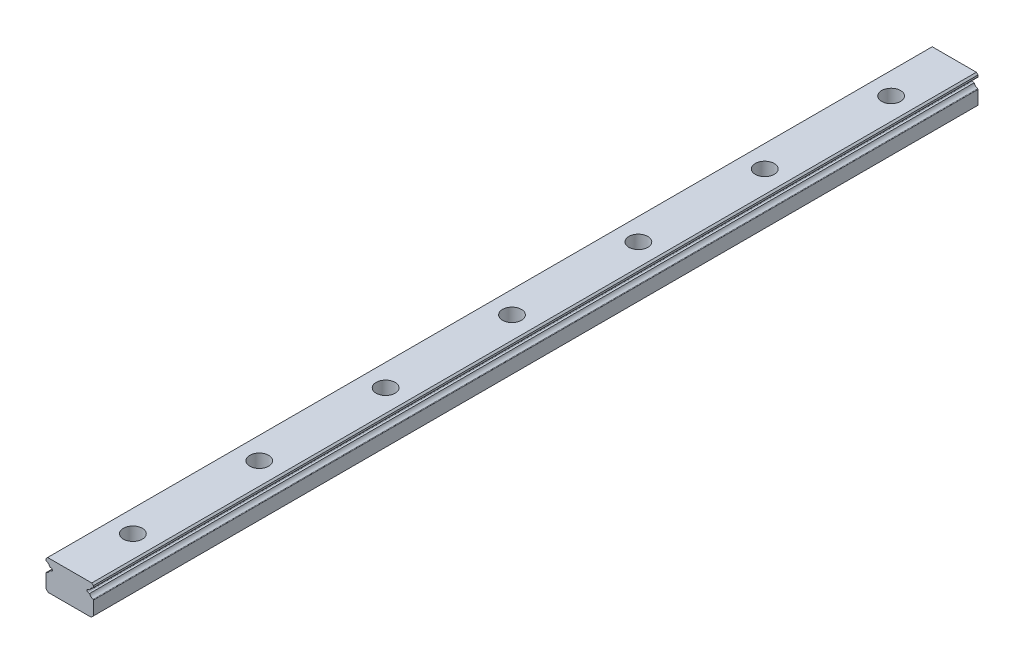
ISO-10303-21;
HEADER;
FILE_DESCRIPTION(('STEP AP214'),'2;1');
FILE_NAME('part.step','',(''),(''),'','','');
FILE_SCHEMA(('AUTOMOTIVE_DESIGN { 1 0 10303 214 1 1 1 1 }'));
ENDSEC;
DATA;
#1=APPLICATION_CONTEXT('core data for automotive mechanical design processes');
#2=APPLICATION_PROTOCOL_DEFINITION('international standard','automotive_design',2000,#1);
#3=PRODUCT_CONTEXT('',#1,'mechanical');
#4=PRODUCT('Part','Part','',(#3));
#5=PRODUCT_RELATED_PRODUCT_CATEGORY('part','',(#4));
#6=PRODUCT_DEFINITION_FORMATION('','',#4);
#7=PRODUCT_DEFINITION_CONTEXT('part definition',#1,'design');
#8=PRODUCT_DEFINITION('design','',#6,#7);
#9=PRODUCT_DEFINITION_SHAPE('','',#8);
#10=(LENGTH_UNIT() NAMED_UNIT(*) SI_UNIT(.MILLI.,.METRE.));
#11=(NAMED_UNIT(*) PLANE_ANGLE_UNIT() SI_UNIT($,.RADIAN.));
#12=(NAMED_UNIT(*) SI_UNIT($,.STERADIAN.) SOLID_ANGLE_UNIT());
#13=UNCERTAINTY_MEASURE_WITH_UNIT(LENGTH_MEASURE(1.E-05),#10,'distance_accuracy_value','');
#14=(GEOMETRIC_REPRESENTATION_CONTEXT(3) GLOBAL_UNCERTAINTY_ASSIGNED_CONTEXT((#13)) GLOBAL_UNIT_ASSIGNED_CONTEXT((#10,
#11,#12)) REPRESENTATION_CONTEXT('',''));
#15=CARTESIAN_POINT('',(0.,0.,0.));
#16=DIRECTION('',(0.,0.,1.));
#17=DIRECTION('',(1.,0.,0.));
#18=AXIS2_PLACEMENT_3D('',#15,#16,#17);
#19=CARTESIAN_POINT('',(-6.27999999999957,-8.749,-280.));
#20=DIRECTION('',(-0.209659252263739,-0.977774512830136,0.));
#21=DIRECTION('',(0.977774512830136,-0.209659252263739,0.));
#22=AXIS2_PLACEMENT_3D('',#19,#20,#21);
#23=PLANE('',#22);
#24=DIRECTION('',(0.977774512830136,-0.209659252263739,0.));
#25=VECTOR('',#24,1.);
#26=CARTESIAN_POINT('',(-6.27999999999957,-8.749,-280.));
#27=LINE('',#26,#25);
#28=CARTESIAN_POINT('',(-6.27999999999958,-8.749,-280.));
#29=VERTEX_POINT('',#28);
#30=CARTESIAN_POINT('',(-5.76751090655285,-8.85889044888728,-280.));
#31=VERTEX_POINT('',#30);
#32=EDGE_CURVE('E211',#29,#31,#27,.T.);
#33=ORIENTED_EDGE('',*,*,#32,.T.);
#34=DIRECTION('',(0.,0.,-1.));
#35=VECTOR('',#34,1.);
#36=CARTESIAN_POINT('',(-5.76751053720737,-8.85889052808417,-280.));
#37=LINE('',#36,#35);
#38=CARTESIAN_POINT('',(-5.76751090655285,-8.85889044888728,0.));
#39=VERTEX_POINT('',#38);
#40=EDGE_CURVE('E182',#31,#39,#37,.F.);
#41=ORIENTED_EDGE('',*,*,#40,.T.);
#42=DIRECTION('',(0.977774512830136,-0.209659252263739,0.));
#43=VECTOR('',#42,1.);
#44=CARTESIAN_POINT('',(-6.27999999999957,-8.749,0.));
#45=LINE('',#44,#43);
#46=CARTESIAN_POINT('',(-6.27999999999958,-8.749,0.));
#47=VERTEX_POINT('',#46);
#48=EDGE_CURVE('E219',#39,#47,#45,.F.);
#49=ORIENTED_EDGE('',*,*,#48,.T.);
#50=DIRECTION('',(0.,0.,-1.));
#51=VECTOR('',#50,1.);
#52=CARTESIAN_POINT('',(-6.27999999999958,-8.749,-280.));
#53=LINE('',#52,#51);
#54=EDGE_CURVE('E214',#47,#29,#53,.T.);
#55=ORIENTED_EDGE('',*,*,#54,.T.);
#56=EDGE_LOOP('',(#33,#41,#49,#55));
#57=FACE_BOUND('',#56,.T.);
#58=ADVANCED_FACE('F16',(#57),#23,.T.);
#59=CARTESIAN_POINT('',(5.7675105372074,-8.85889052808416,-280.));
#60=DIRECTION('',(0.20965925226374,-0.977774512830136,0.));
#61=DIRECTION('',(0.977774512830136,0.20965925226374,0.));
#62=AXIS2_PLACEMENT_3D('',#59,#60,#61);
#63=PLANE('',#62);
#64=DIRECTION('',(0.977774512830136,0.20965925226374,0.));
#65=VECTOR('',#64,1.);
#66=CARTESIAN_POINT('',(5.7675105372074,-8.85889052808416,-280.));
#67=LINE('',#66,#65);
#68=CARTESIAN_POINT('',(5.76751090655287,-8.85889044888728,-280.));
#69=VERTEX_POINT('',#68);
#70=CARTESIAN_POINT('',(6.27999999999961,-8.749,-280.));
#71=VERTEX_POINT('',#70);
#72=EDGE_CURVE('E184',#69,#71,#67,.T.);
#73=ORIENTED_EDGE('',*,*,#72,.T.);
#74=DIRECTION('',(0.,0.,-1.));
#75=VECTOR('',#74,1.);
#76=CARTESIAN_POINT('',(6.27999999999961,-8.749,-280.));
#77=LINE('',#76,#75);
#78=CARTESIAN_POINT('',(6.27999999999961,-8.749,0.));
#79=VERTEX_POINT('',#78);
#80=EDGE_CURVE('E222',#71,#79,#77,.F.);
#81=ORIENTED_EDGE('',*,*,#80,.T.);
#82=DIRECTION('',(0.977774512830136,0.20965925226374,0.));
#83=VECTOR('',#82,1.);
#84=CARTESIAN_POINT('',(5.7675105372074,-8.85889052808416,0.));
#85=LINE('',#84,#83);
#86=CARTESIAN_POINT('',(5.76751090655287,-8.85889044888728,0.));
#87=VERTEX_POINT('',#86);
#88=EDGE_CURVE('E209',#79,#87,#85,.F.);
#89=ORIENTED_EDGE('',*,*,#88,.T.);
#90=DIRECTION('',(0.,0.,-1.));
#91=VECTOR('',#90,1.);
#92=CARTESIAN_POINT('',(5.7675105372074,-8.85889052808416,-280.));
#93=LINE('',#92,#91);
#94=EDGE_CURVE('E204',#87,#69,#93,.T.);
#95=ORIENTED_EDGE('',*,*,#94,.T.);
#96=EDGE_LOOP('',(#73,#81,#89,#95));
#97=FACE_BOUND('',#96,.T.);
#98=ADVANCED_FACE('F960',(#97),#63,.T.);
#99=CARTESIAN_POINT('',(-5.85137497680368,-9.25000017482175,-280.));
#100=DIRECTION('',(0.,0.,-1.));
#101=DIRECTION('',(-1.,0.,0.));
#102=AXIS2_PLACEMENT_3D('',#99,#100,#101);
#103=CYLINDRICAL_SURFACE('',#102,0.4);
#104=ORIENTED_EDGE('',*,*,#40,.F.);
#105=CARTESIAN_POINT('',(-5.85137497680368,-9.25000017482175,-280.));
#106=DIRECTION('',(0.,0.,-1.));
#107=DIRECTION('',(-1.,0.,0.));
#108=AXIS2_PLACEMENT_3D('',#105,#106,#107);
#109=CIRCLE('',#108,0.4);
#110=CARTESIAN_POINT('',(-5.767,-9.641,-280.));
#111=VERTEX_POINT('',#110);
#112=EDGE_CURVE('E19',#111,#31,#109,.F.);
#113=ORIENTED_EDGE('',*,*,#112,.F.);
#114=DIRECTION('',(0.,0.,1.));
#115=VECTOR('',#114,1.);
#116=CARTESIAN_POINT('',(-5.767,-9.641,-280.));
#117=LINE('',#116,#115);
#118=CARTESIAN_POINT('',(-5.767,-9.641,0.));
#119=VERTEX_POINT('',#118);
#120=EDGE_CURVE('E179',#119,#111,#117,.F.);
#121=ORIENTED_EDGE('',*,*,#120,.F.);
#122=CARTESIAN_POINT('',(-5.85137497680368,-9.25000017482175,0.));
#123=DIRECTION('',(0.,0.,-1.));
#124=DIRECTION('',(-1.,0.,0.));
#125=AXIS2_PLACEMENT_3D('',#122,#123,#124);
#126=CIRCLE('',#125,0.4);
#127=EDGE_CURVE('E226',#39,#119,#126,.T.);
#128=ORIENTED_EDGE('',*,*,#127,.F.);
#129=EDGE_LOOP('',(#104,#113,#121,#128));
#130=FACE_BOUND('',#129,.T.);
#131=ADVANCED_FACE('F176',(#130),#103,.F.);
#132=CARTESIAN_POINT('',(7.89004225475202,-9.33975285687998,-280.));
#133=DIRECTION('',(0.,0.,-1.));
#134=DIRECTION('',(-1.,0.,0.));
#135=AXIS2_PLACEMENT_3D('',#132,#133,#134);
#136=CYLINDRICAL_SURFACE('',#135,1.715);
#137=ORIENTED_EDGE('',*,*,#80,.F.);
#138=CARTESIAN_POINT('',(7.89004225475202,-9.33975285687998,-280.));
#139=DIRECTION('',(0.,0.,-1.));
#140=DIRECTION('',(-1.,0.,0.));
#141=AXIS2_PLACEMENT_3D('',#138,#139,#140);
#142=CIRCLE('',#141,1.715);
#143=CARTESIAN_POINT('',(7.35000000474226,-7.71199999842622,-280.));
#144=VERTEX_POINT('',#143);
#145=EDGE_CURVE('E225',#144,#71,#142,.F.);
#146=ORIENTED_EDGE('',*,*,#145,.F.);
#147=DIRECTION('',(0.,0.,-1.));
#148=VECTOR('',#147,1.);
#149=CARTESIAN_POINT('',(7.35000000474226,-7.71199999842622,-280.));
#150=LINE('',#149,#148);
#151=CARTESIAN_POINT('',(7.35000000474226,-7.71199999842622,0.));
#152=VERTEX_POINT('',#151);
#153=EDGE_CURVE('E202',#152,#144,#150,.T.);
#154=ORIENTED_EDGE('',*,*,#153,.F.);
#155=CARTESIAN_POINT('',(7.89004225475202,-9.33975285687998,0.));
#156=DIRECTION('',(0.,0.,-1.));
#157=DIRECTION('',(-1.,0.,0.));
#158=AXIS2_PLACEMENT_3D('',#155,#156,#157);
#159=CIRCLE('',#158,1.715);
#160=EDGE_CURVE('E218',#79,#152,#159,.T.);
#161=ORIENTED_EDGE('',*,*,#160,.F.);
#162=EDGE_LOOP('',(#137,#146,#154,#161));
#163=FACE_BOUND('',#162,.T.);
#164=ADVANCED_FACE('F944',(#163),#136,.F.);
#165=CARTESIAN_POINT('',(-7.890042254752,-9.33975285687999,-280.));
#166=DIRECTION('',(0.,0.,-1.));
#167=DIRECTION('',(-1.,0.,0.));
#168=AXIS2_PLACEMENT_3D('',#165,#166,#167);
#169=CYLINDRICAL_SURFACE('',#168,1.715);
#170=DIRECTION('',(0.,0.,-1.));
#171=VECTOR('',#170,1.);
#172=CARTESIAN_POINT('',(-7.34999999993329,-7.7120000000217,-280.));
#173=LINE('',#172,#171);
#174=CARTESIAN_POINT('',(-7.34999999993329,-7.71200000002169,-280.));
#175=VERTEX_POINT('',#174);
#176=CARTESIAN_POINT('',(-7.34999999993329,-7.7120000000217,0.));
#177=VERTEX_POINT('',#176);
#178=EDGE_CURVE('E345',#175,#177,#173,.F.);
#179=ORIENTED_EDGE('',*,*,#178,.F.);
#180=CARTESIAN_POINT('',(-7.890042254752,-9.33975285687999,-280.));
#181=DIRECTION('',(0.,0.,-1.));
#182=DIRECTION('',(-1.,0.,0.));
#183=AXIS2_PLACEMENT_3D('',#180,#181,#182);
#184=CIRCLE('',#183,1.715);
#185=EDGE_CURVE('E217',#29,#175,#184,.F.);
#186=ORIENTED_EDGE('',*,*,#185,.F.);
#187=ORIENTED_EDGE('',*,*,#54,.F.);
#188=CARTESIAN_POINT('',(-7.890042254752,-9.33975285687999,0.));
#189=DIRECTION('',(0.,0.,-1.));
#190=DIRECTION('',(-1.,0.,0.));
#191=AXIS2_PLACEMENT_3D('',#188,#189,#190);
#192=CIRCLE('',#191,1.715);
#193=EDGE_CURVE('E208',#177,#47,#192,.T.);
#194=ORIENTED_EDGE('',*,*,#193,.F.);
#195=EDGE_LOOP('',(#179,#186,#187,#194));
#196=FACE_BOUND('',#195,.T.);
#197=ADVANCED_FACE('F370',(#196),#169,.F.);
#198=CARTESIAN_POINT('',(5.85137497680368,-9.25000017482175,-280.));
#199=DIRECTION('',(0.,0.,-1.));
#200=DIRECTION('',(-1.,0.,0.));
#201=AXIS2_PLACEMENT_3D('',#198,#199,#200);
#202=CYLINDRICAL_SURFACE('',#201,0.4);
#203=DIRECTION('',(0.,0.,1.));
#204=VECTOR('',#203,1.);
#205=CARTESIAN_POINT('',(5.767,-9.641,-280.));
#206=LINE('',#205,#204);
#207=CARTESIAN_POINT('',(5.767,-9.641,-280.));
#208=VERTEX_POINT('',#207);
#209=CARTESIAN_POINT('',(5.767,-9.641,0.));
#210=VERTEX_POINT('',#209);
#211=EDGE_CURVE('E341',#208,#210,#206,.T.);
#212=ORIENTED_EDGE('',*,*,#211,.F.);
#213=CARTESIAN_POINT('',(5.85137497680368,-9.25000017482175,-280.));
#214=DIRECTION('',(0.,0.,-1.));
#215=DIRECTION('',(-1.,0.,0.));
#216=AXIS2_PLACEMENT_3D('',#213,#214,#215);
#217=CIRCLE('',#216,0.4);
#218=EDGE_CURVE('E207',#69,#208,#217,.F.);
#219=ORIENTED_EDGE('',*,*,#218,.F.);
#220=ORIENTED_EDGE('',*,*,#94,.F.);
#221=CARTESIAN_POINT('',(5.85137497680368,-9.25000017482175,0.));
#222=DIRECTION('',(0.,0.,-1.));
#223=DIRECTION('',(-1.,0.,0.));
#224=AXIS2_PLACEMENT_3D('',#221,#222,#223);
#225=CIRCLE('',#224,0.4);
#226=EDGE_CURVE('E198',#210,#87,#225,.T.);
#227=ORIENTED_EDGE('',*,*,#226,.F.);
#228=EDGE_LOOP('',(#212,#219,#220,#227));
#229=FACE_BOUND('',#228,.T.);
#230=ADVANCED_FACE('F928',(#229),#202,.F.);
#231=CARTESIAN_POINT('',(-5.767,-9.641,-280.));
#232=DIRECTION('',(-0.207835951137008,0.978163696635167,0.));
#233=DIRECTION('',(-0.978163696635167,-0.207835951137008,0.));
#234=AXIS2_PLACEMENT_3D('',#231,#232,#233);
#235=PLANE('',#234);
#236=DIRECTION('',(-0.978163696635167,-0.207835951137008,0.));
#237=VECTOR('',#236,1.);
#238=CARTESIAN_POINT('',(-5.767,-9.641,-280.));
#239=LINE('',#238,#237);
#240=CARTESIAN_POINT('',(-6.28,-9.75,-280.));
#241=VERTEX_POINT('',#240);
#242=EDGE_CURVE('E186',#111,#241,#239,.T.);
#243=ORIENTED_EDGE('',*,*,#242,.T.);
#244=DIRECTION('',(0.,0.,-1.));
#245=VECTOR('',#244,1.);
#246=CARTESIAN_POINT('',(-6.28,-9.75,-280.));
#247=LINE('',#246,#245);
#248=CARTESIAN_POINT('',(-6.28,-9.75,0.));
#249=VERTEX_POINT('',#248);
#250=EDGE_CURVE('E339',#241,#249,#247,.F.);
#251=ORIENTED_EDGE('',*,*,#250,.T.);
#252=DIRECTION('',(-0.978163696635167,-0.207835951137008,0.));
#253=VECTOR('',#252,1.);
#254=CARTESIAN_POINT('',(-5.767,-9.641,0.));
#255=LINE('',#254,#253);
#256=EDGE_CURVE('E196',#249,#119,#255,.F.);
#257=ORIENTED_EDGE('',*,*,#256,.T.);
#258=ORIENTED_EDGE('',*,*,#120,.T.);
#259=EDGE_LOOP('',(#243,#251,#257,#258));
#260=FACE_BOUND('',#259,.T.);
#261=ADVANCED_FACE('F195',(#260),#235,.T.);
#262=CARTESIAN_POINT('',(7.287,-7.52218166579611,-280.));
#263=DIRECTION('',(0.,0.,-1.));
#264=DIRECTION('',(-1.,0.,0.));
#265=AXIS2_PLACEMENT_3D('',#262,#263,#264);
#266=CYLINDRICAL_SURFACE('',#265,0.2);
#267=CARTESIAN_POINT('',(7.287,-7.52218166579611,-280.));
#268=DIRECTION('',(0.,0.,-1.));
#269=DIRECTION('',(-1.,0.,0.));
#270=AXIS2_PLACEMENT_3D('',#267,#268,#269);
#271=CIRCLE('',#270,0.2);
#272=CARTESIAN_POINT('',(7.487,-7.52218165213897,-280.));
#273=VERTEX_POINT('',#272);
#274=EDGE_CURVE('E349',#144,#273,#271,.F.);
#275=ORIENTED_EDGE('',*,*,#274,.T.);
#276=DIRECTION('',(0.,0.,-1.));
#277=VECTOR('',#276,1.);
#278=CARTESIAN_POINT('',(7.487,-7.52218163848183,-280.));
#279=LINE('',#278,#277);
#280=CARTESIAN_POINT('',(7.487,-7.52218165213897,0.));
#281=VERTEX_POINT('',#280);
#282=EDGE_CURVE('E407',#281,#273,#279,.T.);
#283=ORIENTED_EDGE('',*,*,#282,.F.);
#284=CARTESIAN_POINT('',(7.287,-7.52218166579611,0.));
#285=DIRECTION('',(0.,0.,-1.));
#286=DIRECTION('',(-1.,0.,0.));
#287=AXIS2_PLACEMENT_3D('',#284,#285,#286);
#288=CIRCLE('',#287,0.2);
#289=EDGE_CURVE('E193',#281,#152,#288,.T.);
#290=ORIENTED_EDGE('',*,*,#289,.T.);
#291=ORIENTED_EDGE('',*,*,#153,.T.);
#292=EDGE_LOOP('',(#275,#283,#290,#291));
#293=FACE_BOUND('',#292,.T.);
#294=ADVANCED_FACE('F913',(#293),#266,.T.);
#295=CARTESIAN_POINT('',(-7.288,-7.52185268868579,-280.));
#296=DIRECTION('',(0.,0.,-1.));
#297=DIRECTION('',(-1.,0.,0.));
#298=AXIS2_PLACEMENT_3D('',#295,#296,#297);
#299=CYLINDRICAL_SURFACE('',#298,0.200000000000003);
#300=CARTESIAN_POINT('',(-7.288,-7.52185268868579,-280.));
#301=DIRECTION('',(0.,0.,-1.));
#302=DIRECTION('',(-1.,0.,0.));
#303=AXIS2_PLACEMENT_3D('',#300,#301,#302);
#304=CIRCLE('',#303,0.200000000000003);
#305=CARTESIAN_POINT('',(-7.488,-7.52185267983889,-280.));
#306=VERTEX_POINT('',#305);
#307=EDGE_CURVE('E342',#306,#175,#304,.F.);
#308=ORIENTED_EDGE('',*,*,#307,.T.);
#309=ORIENTED_EDGE('',*,*,#178,.T.);
#310=CARTESIAN_POINT('',(-7.288,-7.52185268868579,0.));
#311=DIRECTION('',(0.,0.,-1.));
#312=DIRECTION('',(-1.,0.,0.));
#313=AXIS2_PLACEMENT_3D('',#310,#311,#312);
#314=CIRCLE('',#313,0.200000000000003);
#315=CARTESIAN_POINT('',(-7.488,-7.52185267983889,0.));
#316=VERTEX_POINT('',#315);
#317=EDGE_CURVE('E346',#177,#316,#314,.T.);
#318=ORIENTED_EDGE('',*,*,#317,.T.);
#319=DIRECTION('',(0.,0.,1.));
#320=VECTOR('',#319,1.);
#321=CARTESIAN_POINT('',(-7.488,-7.52185267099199,-280.));
#322=LINE('',#321,#320);
#323=EDGE_CURVE('E375',#306,#316,#322,.T.);
#324=ORIENTED_EDGE('',*,*,#323,.F.);
#325=EDGE_LOOP('',(#308,#309,#318,#324));
#326=FACE_BOUND('',#325,.T.);
#327=ADVANCED_FACE('F373',(#326),#299,.T.);
#328=CARTESIAN_POINT('',(6.28,-9.75,-280.));
#329=DIRECTION('',(0.207835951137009,0.978163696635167,0.));
#330=DIRECTION('',(-0.978163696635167,0.207835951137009,0.));
#331=AXIS2_PLACEMENT_3D('',#328,#329,#330);
#332=PLANE('',#331);
#333=DIRECTION('',(-0.978163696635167,0.207835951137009,0.));
#334=VECTOR('',#333,1.);
#335=CARTESIAN_POINT('',(6.28,-9.75,-280.));
#336=LINE('',#335,#334);
#337=CARTESIAN_POINT('',(6.28,-9.75,-280.));
#338=VERTEX_POINT('',#337);
#339=EDGE_CURVE('E431',#338,#208,#336,.T.);
#340=ORIENTED_EDGE('',*,*,#339,.T.);
#341=ORIENTED_EDGE('',*,*,#211,.T.);
#342=DIRECTION('',(-0.978163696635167,0.207835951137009,0.));
#343=VECTOR('',#342,1.);
#344=CARTESIAN_POINT('',(6.28,-9.75,0.));
#345=LINE('',#344,#343);
#346=CARTESIAN_POINT('',(6.28,-9.75,0.));
#347=VERTEX_POINT('',#346);
#348=EDGE_CURVE('E372',#210,#347,#345,.F.);
#349=ORIENTED_EDGE('',*,*,#348,.T.);
#350=DIRECTION('',(0.,0.,-1.));
#351=VECTOR('',#350,1.);
#352=CARTESIAN_POINT('',(6.28,-9.75,-280.));
#353=LINE('',#352,#351);
#354=EDGE_CURVE('E335',#347,#338,#353,.T.);
#355=ORIENTED_EDGE('',*,*,#354,.T.);
#356=EDGE_LOOP('',(#340,#341,#349,#355));
#357=FACE_BOUND('',#356,.T.);
#358=ADVANCED_FACE('F538',(#357),#332,.T.);
#359=CARTESIAN_POINT('',(-7.89007044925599,-9.159323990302,-280.));
#360=DIRECTION('',(0.,0.,-1.));
#361=DIRECTION('',(-1.,0.,0.));
#362=AXIS2_PLACEMENT_3D('',#359,#360,#361);
#363=CYLINDRICAL_SURFACE('',#362,1.715);
#364=ORIENTED_EDGE('',*,*,#250,.F.);
#365=CARTESIAN_POINT('',(-7.89007044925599,-9.159323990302,-280.));
#366=DIRECTION('',(0.,0.,-1.));
#367=DIRECTION('',(-1.,0.,0.));
#368=AXIS2_PLACEMENT_3D('',#365,#366,#367);
#369=CIRCLE('',#368,1.715);
#370=CARTESIAN_POINT('',(-7.36199999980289,-10.7909999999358,-280.));
#371=VERTEX_POINT('',#370);
#372=EDGE_CURVE('E189',#371,#241,#369,.F.);
#373=ORIENTED_EDGE('',*,*,#372,.F.);
#374=DIRECTION('',(0.,0.,-1.));
#375=VECTOR('',#374,1.);
#376=CARTESIAN_POINT('',(-7.36199999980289,-10.7909999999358,-280.));
#377=LINE('',#376,#375);
#378=CARTESIAN_POINT('',(-7.36199999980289,-10.7909999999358,0.));
#379=VERTEX_POINT('',#378);
#380=EDGE_CURVE('E326',#379,#371,#377,.T.);
#381=ORIENTED_EDGE('',*,*,#380,.F.);
#382=CARTESIAN_POINT('',(-7.89007044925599,-9.159323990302,0.));
#383=DIRECTION('',(0.,0.,-1.));
#384=DIRECTION('',(-1.,0.,0.));
#385=AXIS2_PLACEMENT_3D('',#382,#383,#384);
#386=CIRCLE('',#385,1.715);
#387=EDGE_CURVE('E336',#249,#379,#386,.T.);
#388=ORIENTED_EDGE('',*,*,#387,.F.);
#389=EDGE_LOOP('',(#364,#373,#381,#388));
#390=FACE_BOUND('',#389,.T.);
#391=ADVANCED_FACE('F535',(#390),#363,.F.);
#392=CARTESIAN_POINT('',(7.487,-7.52218163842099,-280.));
#393=DIRECTION('',(1.,0.,0.));
#394=DIRECTION('',(0.,0.,-1.));
#395=AXIS2_PLACEMENT_3D('',#392,#393,#394);
#396=PLANE('',#395);
#397=DIRECTION('',(0.,1.,0.));
#398=VECTOR('',#397,1.);
#399=CARTESIAN_POINT('',(7.487,-7.52218163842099,-280.));
#400=LINE('',#399,#398);
#401=CARTESIAN_POINT('',(7.487,-7.,-280.));
#402=VERTEX_POINT('',#401);
#403=EDGE_CURVE('E387',#273,#402,#400,.T.);
#404=ORIENTED_EDGE('',*,*,#403,.T.);
#405=DIRECTION('',(0.,0.,1.));
#406=VECTOR('',#405,1.);
#407=CARTESIAN_POINT('',(7.487,-7.,-280.));
#408=LINE('',#407,#406);
#409=CARTESIAN_POINT('',(7.487,-7.,0.));
#410=VERTEX_POINT('',#409);
#411=EDGE_CURVE('E414',#410,#402,#408,.F.);
#412=ORIENTED_EDGE('',*,*,#411,.F.);
#413=DIRECTION('',(0.,1.,0.));
#414=VECTOR('',#413,1.);
#415=CARTESIAN_POINT('',(7.487,-7.52218163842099,0.));
#416=LINE('',#415,#414);
#417=EDGE_CURVE('E338',#410,#281,#416,.F.);
#418=ORIENTED_EDGE('',*,*,#417,.T.);
#419=ORIENTED_EDGE('',*,*,#282,.T.);
#420=EDGE_LOOP('',(#404,#412,#418,#419));
#421=FACE_BOUND('',#420,.T.);
#422=ADVANCED_FACE('F537',(#421),#396,.T.);
#423=CARTESIAN_POINT('',(-7.488,-7.,-280.));
#424=DIRECTION('',(-1.,0.,0.));
#425=DIRECTION('',(0.,0.,1.));
#426=AXIS2_PLACEMENT_3D('',#423,#424,#425);
#427=PLANE('',#426);
#428=DIRECTION('',(0.,1.,0.));
#429=VECTOR('',#428,1.);
#430=CARTESIAN_POINT('',(-7.488,-7.,-280.));
#431=LINE('',#430,#429);
#432=CARTESIAN_POINT('',(-7.488,-7.,-280.));
#433=VERTEX_POINT('',#432);
#434=EDGE_CURVE('E379',#433,#306,#431,.F.);
#435=ORIENTED_EDGE('',*,*,#434,.T.);
#436=ORIENTED_EDGE('',*,*,#323,.T.);
#437=DIRECTION('',(0.,1.,0.));
#438=VECTOR('',#437,1.);
#439=CARTESIAN_POINT('',(-7.488,-7.,0.));
#440=LINE('',#439,#438);
#441=CARTESIAN_POINT('',(-7.488,-7.,0.));
#442=VERTEX_POINT('',#441);
#443=EDGE_CURVE('E385',#316,#442,#440,.T.);
#444=ORIENTED_EDGE('',*,*,#443,.T.);
#445=DIRECTION('',(0.,0.,1.));
#446=VECTOR('',#445,1.);
#447=CARTESIAN_POINT('',(-7.488,-7.,-280.));
#448=LINE('',#447,#446);
#449=EDGE_CURVE('E322',#433,#442,#448,.T.);
#450=ORIENTED_EDGE('',*,*,#449,.F.);
#451=EDGE_LOOP('',(#435,#436,#444,#450));
#452=FACE_BOUND('',#451,.T.);
#453=ADVANCED_FACE('F382',(#452),#427,.T.);
#454=CARTESIAN_POINT('',(7.890070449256,-9.159323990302,-280.));
#455=DIRECTION('',(0.,0.,-1.));
#456=DIRECTION('',(-1.,0.,0.));
#457=AXIS2_PLACEMENT_3D('',#454,#455,#456);
#458=CYLINDRICAL_SURFACE('',#457,1.715);
#459=DIRECTION('',(0.,0.,-1.));
#460=VECTOR('',#459,1.);
#461=CARTESIAN_POINT('',(7.36199999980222,-10.7909999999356,-280.));
#462=LINE('',#461,#460);
#463=CARTESIAN_POINT('',(7.36199999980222,-10.7909999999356,-280.));
#464=VERTEX_POINT('',#463);
#465=CARTESIAN_POINT('',(7.36199999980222,-10.7909999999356,0.));
#466=VERTEX_POINT('',#465);
#467=EDGE_CURVE('E316',#464,#466,#462,.F.);
#468=ORIENTED_EDGE('',*,*,#467,.F.);
#469=CARTESIAN_POINT('',(7.890070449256,-9.159323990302,-280.));
#470=DIRECTION('',(0.,0.,-1.));
#471=DIRECTION('',(-1.,0.,0.));
#472=AXIS2_PLACEMENT_3D('',#469,#470,#471);
#473=CIRCLE('',#472,1.715);
#474=EDGE_CURVE('E333',#338,#464,#473,.F.);
#475=ORIENTED_EDGE('',*,*,#474,.F.);
#476=ORIENTED_EDGE('',*,*,#354,.F.);
#477=CARTESIAN_POINT('',(7.890070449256,-9.159323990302,0.));
#478=DIRECTION('',(0.,0.,-1.));
#479=DIRECTION('',(-1.,0.,0.));
#480=AXIS2_PLACEMENT_3D('',#477,#478,#479);
#481=CIRCLE('',#480,1.715);
#482=EDGE_CURVE('E330',#466,#347,#481,.T.);
#483=ORIENTED_EDGE('',*,*,#482,.F.);
#484=EDGE_LOOP('',(#468,#475,#476,#483));
#485=FACE_BOUND('',#484,.T.);
#486=ADVANCED_FACE('F673',(#485),#458,.F.);
#487=CARTESIAN_POINT('',(-7.3,-10.9811473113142,-280.));
#488=DIRECTION('',(0.,0.,-1.));
#489=DIRECTION('',(-1.,0.,0.));
#490=AXIS2_PLACEMENT_3D('',#487,#488,#489);
#491=CYLINDRICAL_SURFACE('',#490,0.200000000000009);
#492=CARTESIAN_POINT('',(-7.3,-10.9811473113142,-280.));
#493=DIRECTION('',(0.,0.,-1.));
#494=DIRECTION('',(-1.,0.,0.));
#495=AXIS2_PLACEMENT_3D('',#492,#493,#494);
#496=CIRCLE('',#495,0.200000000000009);
#497=CARTESIAN_POINT('',(-7.5,-10.9811473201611,-280.));
#498=VERTEX_POINT('',#497);
#499=EDGE_CURVE('E323',#371,#498,#496,.F.);
#500=ORIENTED_EDGE('',*,*,#499,.T.);
#501=DIRECTION('',(0.,0.,1.));
#502=VECTOR('',#501,1.);
#503=CARTESIAN_POINT('',(-7.5,-10.981147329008,-280.));
#504=LINE('',#503,#502);
#505=CARTESIAN_POINT('',(-7.5,-10.9811473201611,0.));
#506=VERTEX_POINT('',#505);
#507=EDGE_CURVE('E306',#506,#498,#504,.F.);
#508=ORIENTED_EDGE('',*,*,#507,.F.);
#509=CARTESIAN_POINT('',(-7.3,-10.9811473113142,0.));
#510=DIRECTION('',(0.,0.,-1.));
#511=DIRECTION('',(-1.,0.,0.));
#512=AXIS2_PLACEMENT_3D('',#509,#510,#511);
#513=CIRCLE('',#512,0.200000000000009);
#514=EDGE_CURVE('E327',#506,#379,#513,.T.);
#515=ORIENTED_EDGE('',*,*,#514,.T.);
#516=ORIENTED_EDGE('',*,*,#380,.T.);
#517=EDGE_LOOP('',(#500,#508,#515,#516));
#518=FACE_BOUND('',#517,.T.);
#519=ADVANCED_FACE('F531',(#518),#491,.T.);
#520=CARTESIAN_POINT('',(0.,-22.5,-220.));
#521=DIRECTION('',(0.,1.,0.));
#522=DIRECTION('',(0.,0.,1.));
#523=AXIS2_PLACEMENT_3D('',#520,#521,#522);
#524=CYLINDRICAL_SURFACE('',#523,3.);
#525=CARTESIAN_POINT('',(0.,-6.5,-220.));
#526=DIRECTION('',(0.,1.,0.));
#527=DIRECTION('',(0.,0.,1.));
#528=AXIS2_PLACEMENT_3D('',#525,#526,#527);
#529=CIRCLE('',#528,3.);
#530=CARTESIAN_POINT('',(0.,-6.5,-217.));
#531=VERTEX_POINT('',#530);
#532=EDGE_CURVE('E303',#531,#531,#529,.F.);
#533=ORIENTED_EDGE('',*,*,#532,.F.);
#534=EDGE_LOOP('',(#533));
#535=FACE_BOUND('',#534,.T.);
#536=CARTESIAN_POINT('',(0.,-11.,-220.));
#537=DIRECTION('',(0.,1.,0.));
#538=DIRECTION('',(0.,0.,1.));
#539=AXIS2_PLACEMENT_3D('',#536,#537,#538);
#540=CIRCLE('',#539,3.);
#541=CARTESIAN_POINT('',(0.,-11.,-217.));
#542=VERTEX_POINT('',#541);
#543=EDGE_CURVE('E313',#542,#542,#540,.T.);
#544=ORIENTED_EDGE('',*,*,#543,.F.);
#545=EDGE_LOOP('',(#544));
#546=FACE_BOUND('',#545,.T.);
#547=ADVANCED_FACE('F666',(#535,#546),#524,.F.);
#548=CARTESIAN_POINT('',(0.,-16.,-140.));
#549=DIRECTION('',(0.,1.,0.));
#550=DIRECTION('',(0.,0.,1.));
#551=AXIS2_PLACEMENT_3D('',#548,#549,#550);
#552=CYLINDRICAL_SURFACE('',#551,3.);
#553=CARTESIAN_POINT('',(0.,-6.5,-140.));
#554=DIRECTION('',(0.,1.,0.));
#555=DIRECTION('',(0.,0.,1.));
#556=AXIS2_PLACEMENT_3D('',#553,#554,#555);
#557=CIRCLE('',#556,3.);
#558=CARTESIAN_POINT('',(0.,-6.5,-137.));
#559=VERTEX_POINT('',#558);
#560=EDGE_CURVE('E300',#559,#559,#557,.F.);
#561=ORIENTED_EDGE('',*,*,#560,.F.);
#562=EDGE_LOOP('',(#561));
#563=FACE_BOUND('',#562,.T.);
#564=CARTESIAN_POINT('',(0.,-11.,-140.));
#565=DIRECTION('',(0.,1.,0.));
#566=DIRECTION('',(0.,0.,1.));
#567=AXIS2_PLACEMENT_3D('',#564,#565,#566);
#568=CIRCLE('',#567,3.);
#569=CARTESIAN_POINT('',(0.,-11.,-137.));
#570=VERTEX_POINT('',#569);
#571=EDGE_CURVE('E310',#570,#570,#568,.T.);
#572=ORIENTED_EDGE('',*,*,#571,.F.);
#573=EDGE_LOOP('',(#572));
#574=FACE_BOUND('',#573,.T.);
#575=ADVANCED_FACE('F662',(#563,#574),#552,.F.);
#576=CARTESIAN_POINT('',(0.,-16.,-60.));
#577=DIRECTION('',(0.,1.,0.));
#578=DIRECTION('',(0.,0.,1.));
#579=AXIS2_PLACEMENT_3D('',#576,#577,#578);
#580=CYLINDRICAL_SURFACE('',#579,3.);
#581=CARTESIAN_POINT('',(0.,-6.5,-60.));
#582=DIRECTION('',(0.,1.,0.));
#583=DIRECTION('',(0.,0.,1.));
#584=AXIS2_PLACEMENT_3D('',#581,#582,#583);
#585=CIRCLE('',#584,3.);
#586=CARTESIAN_POINT('',(0.,-6.5,-57.));
#587=VERTEX_POINT('',#586);
#588=EDGE_CURVE('E296',#587,#587,#585,.F.);
#589=ORIENTED_EDGE('',*,*,#588,.F.);
#590=EDGE_LOOP('',(#589));
#591=FACE_BOUND('',#590,.T.);
#592=CARTESIAN_POINT('',(0.,-11.,-60.));
#593=DIRECTION('',(0.,1.,0.));
#594=DIRECTION('',(0.,0.,1.));
#595=AXIS2_PLACEMENT_3D('',#592,#593,#594);
#596=CIRCLE('',#595,3.);
#597=CARTESIAN_POINT('',(0.,-11.,-57.));
#598=VERTEX_POINT('',#597);
#599=EDGE_CURVE('E307',#598,#598,#596,.T.);
#600=ORIENTED_EDGE('',*,*,#599,.F.);
#601=EDGE_LOOP('',(#600));
#602=FACE_BOUND('',#601,.T.);
#603=ADVANCED_FACE('F658',(#591,#602),#580,.F.);
#604=CARTESIAN_POINT('',(7.487,-7.,-280.));
#605=DIRECTION('',(0.707106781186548,0.707106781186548,0.));
#606=DIRECTION('',(-0.707106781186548,0.707106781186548,0.));
#607=AXIS2_PLACEMENT_3D('',#604,#605,#606);
#608=PLANE('',#607);
#609=DIRECTION('',(-0.707106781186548,0.707106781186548,0.));
#610=VECTOR('',#609,1.);
#611=CARTESIAN_POINT('',(7.487,-7.,-280.));
#612=LINE('',#611,#610);
#613=CARTESIAN_POINT('',(6.987,-6.5,-280.));
#614=VERTEX_POINT('',#613);
#615=EDGE_CURVE('E404',#402,#614,#612,.T.);
#616=ORIENTED_EDGE('',*,*,#615,.T.);
#617=DIRECTION('',(0.,0.,1.));
#618=VECTOR('',#617,1.);
#619=CARTESIAN_POINT('',(6.987,-6.5,-280.));
#620=LINE('',#619,#618);
#621=CARTESIAN_POINT('',(6.987,-6.5,0.));
#622=VERTEX_POINT('',#621);
#623=EDGE_CURVE('E299',#622,#614,#620,.F.);
#624=ORIENTED_EDGE('',*,*,#623,.F.);
#625=DIRECTION('',(-0.707106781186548,0.707106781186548,0.));
#626=VECTOR('',#625,1.);
#627=CARTESIAN_POINT('',(7.487,-7.,1.11022302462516E-13));
#628=LINE('',#627,#626);
#629=EDGE_CURVE('E325',#622,#410,#628,.F.);
#630=ORIENTED_EDGE('',*,*,#629,.T.);
#631=ORIENTED_EDGE('',*,*,#411,.T.);
#632=EDGE_LOOP('',(#616,#624,#630,#631));
#633=FACE_BOUND('',#632,.T.);
#634=ADVANCED_FACE('F654',(#633),#608,.T.);
#635=CARTESIAN_POINT('',(-6.988,-6.5,-280.));
#636=DIRECTION('',(-0.707106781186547,0.707106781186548,0.));
#637=DIRECTION('',(-0.707106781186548,-0.707106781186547,0.));
#638=AXIS2_PLACEMENT_3D('',#635,#636,#637);
#639=PLANE('',#638);
#640=DIRECTION('',(-0.707106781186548,-0.707106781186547,0.));
#641=VECTOR('',#640,1.);
#642=CARTESIAN_POINT('',(-6.988,-6.5,-280.));
#643=LINE('',#642,#641);
#644=CARTESIAN_POINT('',(-6.988,-6.5,-280.));
#645=VERTEX_POINT('',#644);
#646=EDGE_CURVE('E394',#645,#433,#643,.T.);
#647=ORIENTED_EDGE('',*,*,#646,.T.);
#648=ORIENTED_EDGE('',*,*,#449,.T.);
#649=DIRECTION('',(-0.707106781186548,-0.707106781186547,0.));
#650=VECTOR('',#649,1.);
#651=CARTESIAN_POINT('',(-6.988,-6.5,0.));
#652=LINE('',#651,#650);
#653=CARTESIAN_POINT('',(-6.988,-6.5,0.));
#654=VERTEX_POINT('',#653);
#655=EDGE_CURVE('E398',#442,#654,#652,.F.);
#656=ORIENTED_EDGE('',*,*,#655,.T.);
#657=DIRECTION('',(0.,0.,1.));
#658=VECTOR('',#657,1.);
#659=CARTESIAN_POINT('',(-6.988,-6.5,-280.));
#660=LINE('',#659,#658);
#661=EDGE_CURVE('E295',#645,#654,#660,.T.);
#662=ORIENTED_EDGE('',*,*,#661,.F.);
#663=EDGE_LOOP('',(#647,#648,#656,#662));
#664=FACE_BOUND('',#663,.T.);
#665=ADVANCED_FACE('F650',(#664),#639,.T.);
#666=CARTESIAN_POINT('',(7.3,-10.9811473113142,-280.));
#667=DIRECTION('',(0.,0.,-1.));
#668=DIRECTION('',(-1.,0.,0.));
#669=AXIS2_PLACEMENT_3D('',#666,#667,#668);
#670=CYLINDRICAL_SURFACE('',#669,0.2);
#671=CARTESIAN_POINT('',(7.3,-10.9811473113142,-280.));
#672=DIRECTION('',(0.,0.,-1.));
#673=DIRECTION('',(-1.,0.,0.));
#674=AXIS2_PLACEMENT_3D('',#671,#672,#673);
#675=CIRCLE('',#674,0.2);
#676=CARTESIAN_POINT('',(7.5,-10.9811473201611,-280.));
#677=VERTEX_POINT('',#676);
#678=EDGE_CURVE('E317',#677,#464,#675,.F.);
#679=ORIENTED_EDGE('',*,*,#678,.T.);
#680=ORIENTED_EDGE('',*,*,#467,.T.);
#681=CARTESIAN_POINT('',(7.3,-10.9811473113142,0.));
#682=DIRECTION('',(0.,0.,-1.));
#683=DIRECTION('',(-1.,0.,0.));
#684=AXIS2_PLACEMENT_3D('',#681,#682,#683);
#685=CIRCLE('',#684,0.2);
#686=CARTESIAN_POINT('',(7.5,-10.9811473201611,0.));
#687=VERTEX_POINT('',#686);
#688=EDGE_CURVE('E320',#466,#687,#685,.T.);
#689=ORIENTED_EDGE('',*,*,#688,.T.);
#690=DIRECTION('',(0.,0.,-1.));
#691=VECTOR('',#690,1.);
#692=CARTESIAN_POINT('',(7.5,-10.981147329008,-280.));
#693=LINE('',#692,#691);
#694=EDGE_CURVE('E282',#677,#687,#693,.F.);
#695=ORIENTED_EDGE('',*,*,#694,.F.);
#696=EDGE_LOOP('',(#679,#680,#689,#695));
#697=FACE_BOUND('',#696,.T.);
#698=ADVANCED_FACE('F646',(#697),#670,.T.);
#699=CARTESIAN_POINT('',(0.,-16.,-20.));
#700=DIRECTION('',(0.,1.,0.));
#701=DIRECTION('',(0.,0.,1.));
#702=AXIS2_PLACEMENT_3D('',#699,#700,#701);
#703=CYLINDRICAL_SURFACE('',#702,3.);
#704=CARTESIAN_POINT('',(0.,-6.5,-20.));
#705=DIRECTION('',(0.,1.,0.));
#706=DIRECTION('',(0.,0.,1.));
#707=AXIS2_PLACEMENT_3D('',#704,#705,#706);
#708=CIRCLE('',#707,3.);
#709=CARTESIAN_POINT('',(0.,-6.5,-17.));
#710=VERTEX_POINT('',#709);
#711=EDGE_CURVE('E292',#710,#710,#708,.F.);
#712=ORIENTED_EDGE('',*,*,#711,.F.);
#713=EDGE_LOOP('',(#712));
#714=FACE_BOUND('',#713,.T.);
#715=CARTESIAN_POINT('',(0.,-11.,-20.));
#716=DIRECTION('',(0.,1.,0.));
#717=DIRECTION('',(0.,0.,1.));
#718=AXIS2_PLACEMENT_3D('',#715,#716,#717);
#719=CIRCLE('',#718,3.);
#720=CARTESIAN_POINT('',(0.,-11.,-17.));
#721=VERTEX_POINT('',#720);
#722=EDGE_CURVE('E279',#721,#721,#719,.T.);
#723=ORIENTED_EDGE('',*,*,#722,.F.);
#724=EDGE_LOOP('',(#723));
#725=FACE_BOUND('',#724,.T.);
#726=ADVANCED_FACE('F642',(#714,#725),#703,.F.);
#727=CARTESIAN_POINT('',(0.,-16.,-100.));
#728=DIRECTION('',(0.,1.,0.));
#729=DIRECTION('',(0.,0.,1.));
#730=AXIS2_PLACEMENT_3D('',#727,#728,#729);
#731=CYLINDRICAL_SURFACE('',#730,3.);
#732=CARTESIAN_POINT('',(0.,-6.5,-100.));
#733=DIRECTION('',(0.,1.,0.));
#734=DIRECTION('',(0.,0.,1.));
#735=AXIS2_PLACEMENT_3D('',#732,#733,#734);
#736=CIRCLE('',#735,3.);
#737=CARTESIAN_POINT('',(0.,-6.5,-97.));
#738=VERTEX_POINT('',#737);
#739=EDGE_CURVE('E289',#738,#738,#736,.F.);
#740=ORIENTED_EDGE('',*,*,#739,.F.);
#741=EDGE_LOOP('',(#740));
#742=FACE_BOUND('',#741,.T.);
#743=CARTESIAN_POINT('',(0.,-11.,-100.));
#744=DIRECTION('',(0.,1.,0.));
#745=DIRECTION('',(0.,0.,1.));
#746=AXIS2_PLACEMENT_3D('',#743,#744,#745);
#747=CIRCLE('',#746,3.);
#748=CARTESIAN_POINT('',(0.,-11.,-97.));
#749=VERTEX_POINT('',#748);
#750=EDGE_CURVE('E276',#749,#749,#747,.T.);
#751=ORIENTED_EDGE('',*,*,#750,.F.);
#752=EDGE_LOOP('',(#751));
#753=FACE_BOUND('',#752,.T.);
#754=ADVANCED_FACE('F638',(#742,#753),#731,.F.);
#755=CARTESIAN_POINT('',(0.,-16.,-180.));
#756=DIRECTION('',(0.,1.,0.));
#757=DIRECTION('',(0.,0.,1.));
#758=AXIS2_PLACEMENT_3D('',#755,#756,#757);
#759=CYLINDRICAL_SURFACE('',#758,3.);
#760=CARTESIAN_POINT('',(0.,-6.5,-180.));
#761=DIRECTION('',(0.,1.,0.));
#762=DIRECTION('',(0.,0.,1.));
#763=AXIS2_PLACEMENT_3D('',#760,#761,#762);
#764=CIRCLE('',#763,3.);
#765=CARTESIAN_POINT('',(0.,-6.5,-177.));
#766=VERTEX_POINT('',#765);
#767=EDGE_CURVE('E286',#766,#766,#764,.F.);
#768=ORIENTED_EDGE('',*,*,#767,.F.);
#769=EDGE_LOOP('',(#768));
#770=FACE_BOUND('',#769,.T.);
#771=CARTESIAN_POINT('',(0.,-11.,-180.));
#772=DIRECTION('',(0.,1.,0.));
#773=DIRECTION('',(0.,0.,1.));
#774=AXIS2_PLACEMENT_3D('',#771,#772,#773);
#775=CIRCLE('',#774,3.);
#776=CARTESIAN_POINT('',(0.,-11.,-177.));
#777=VERTEX_POINT('',#776);
#778=EDGE_CURVE('E273',#777,#777,#775,.T.);
#779=ORIENTED_EDGE('',*,*,#778,.F.);
#780=EDGE_LOOP('',(#779));
#781=FACE_BOUND('',#780,.T.);
#782=ADVANCED_FACE('F634',(#770,#781),#759,.F.);
#783=CARTESIAN_POINT('',(0.,-22.5,-260.));
#784=DIRECTION('',(0.,1.,0.));
#785=DIRECTION('',(0.,0.,1.));
#786=AXIS2_PLACEMENT_3D('',#783,#784,#785);
#787=CYLINDRICAL_SURFACE('',#786,3.);
#788=CARTESIAN_POINT('',(0.,-6.5,-260.));
#789=DIRECTION('',(0.,1.,0.));
#790=DIRECTION('',(0.,0.,1.));
#791=AXIS2_PLACEMENT_3D('',#788,#789,#790);
#792=CIRCLE('',#791,3.);
#793=CARTESIAN_POINT('',(0.,-6.5,-257.));
#794=VERTEX_POINT('',#793);
#795=EDGE_CURVE('E283',#794,#794,#792,.F.);
#796=ORIENTED_EDGE('',*,*,#795,.F.);
#797=EDGE_LOOP('',(#796));
#798=FACE_BOUND('',#797,.T.);
#799=CARTESIAN_POINT('',(0.,-11.,-260.));
#800=DIRECTION('',(0.,1.,0.));
#801=DIRECTION('',(0.,0.,1.));
#802=AXIS2_PLACEMENT_3D('',#799,#800,#801);
#803=CIRCLE('',#802,3.);
#804=CARTESIAN_POINT('',(0.,-11.,-257.));
#805=VERTEX_POINT('',#804);
#806=EDGE_CURVE('E270',#805,#805,#803,.T.);
#807=ORIENTED_EDGE('',*,*,#806,.F.);
#808=EDGE_LOOP('',(#807));
#809=FACE_BOUND('',#808,.T.);
#810=ADVANCED_FACE('F630',(#798,#809),#787,.F.);
#811=CARTESIAN_POINT('',(0.,-11.,-223.));
#812=DIRECTION('',(0.,1.,0.));
#813=DIRECTION('',(0.,0.,1.));
#814=AXIS2_PLACEMENT_3D('',#811,#812,#813);
#815=PLANE('',#814);
#816=ORIENTED_EDGE('',*,*,#543,.T.);
#817=EDGE_LOOP('',(#816));
#818=FACE_BOUND('',#817,.T.);
#819=CARTESIAN_POINT('',(0.,-11.,-220.));
#820=DIRECTION('',(0.,1.,0.));
#821=DIRECTION('',(0.,0.,1.));
#822=AXIS2_PLACEMENT_3D('',#819,#820,#821);
#823=CIRCLE('',#822,1.75);
#824=CARTESIAN_POINT('',(0.,-11.,-218.25));
#825=VERTEX_POINT('',#824);
#826=EDGE_CURVE('E267',#825,#825,#823,.F.);
#827=ORIENTED_EDGE('',*,*,#826,.T.);
#828=EDGE_LOOP('',(#827));
#829=FACE_BOUND('',#828,.T.);
#830=ADVANCED_FACE('F626',(#818,#829),#815,.T.);
#831=CARTESIAN_POINT('',(0.,-11.,-143.));
#832=DIRECTION('',(0.,1.,0.));
#833=DIRECTION('',(0.,0.,1.));
#834=AXIS2_PLACEMENT_3D('',#831,#832,#833);
#835=PLANE('',#834);
#836=ORIENTED_EDGE('',*,*,#571,.T.);
#837=EDGE_LOOP('',(#836));
#838=FACE_BOUND('',#837,.T.);
#839=CARTESIAN_POINT('',(0.,-11.,-140.));
#840=DIRECTION('',(0.,1.,0.));
#841=DIRECTION('',(0.,0.,1.));
#842=AXIS2_PLACEMENT_3D('',#839,#840,#841);
#843=CIRCLE('',#842,1.75);
#844=CARTESIAN_POINT('',(0.,-11.,-138.25));
#845=VERTEX_POINT('',#844);
#846=EDGE_CURVE('E264',#845,#845,#843,.F.);
#847=ORIENTED_EDGE('',*,*,#846,.T.);
#848=EDGE_LOOP('',(#847));
#849=FACE_BOUND('',#848,.T.);
#850=ADVANCED_FACE('F622',(#838,#849),#835,.T.);
#851=CARTESIAN_POINT('',(0.,-11.,-63.));
#852=DIRECTION('',(0.,1.,0.));
#853=DIRECTION('',(0.,0.,1.));
#854=AXIS2_PLACEMENT_3D('',#851,#852,#853);
#855=PLANE('',#854);
#856=ORIENTED_EDGE('',*,*,#599,.T.);
#857=EDGE_LOOP('',(#856));
#858=FACE_BOUND('',#857,.T.);
#859=CARTESIAN_POINT('',(0.,-11.,-60.));
#860=DIRECTION('',(0.,1.,0.));
#861=DIRECTION('',(0.,0.,1.));
#862=AXIS2_PLACEMENT_3D('',#859,#860,#861);
#863=CIRCLE('',#862,1.75);
#864=CARTESIAN_POINT('',(0.,-11.,-58.25));
#865=VERTEX_POINT('',#864);
#866=EDGE_CURVE('E260',#865,#865,#863,.F.);
#867=ORIENTED_EDGE('',*,*,#866,.T.);
#868=EDGE_LOOP('',(#867));
#869=FACE_BOUND('',#868,.T.);
#870=ADVANCED_FACE('F619',(#858,#869),#855,.T.);
#871=CARTESIAN_POINT('',(-7.5,-10.981147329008,-280.));
#872=DIRECTION('',(-1.,0.,0.));
#873=DIRECTION('',(0.,0.,1.));
#874=AXIS2_PLACEMENT_3D('',#871,#872,#873);
#875=PLANE('',#874);
#876=DIRECTION('',(0.,1.,0.));
#877=VECTOR('',#876,1.);
#878=CARTESIAN_POINT('',(-7.5,-10.9811473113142,-280.));
#879=LINE('',#878,#877);
#880=CARTESIAN_POINT('',(-7.5,-15.3,-280.));
#881=VERTEX_POINT('',#880);
#882=EDGE_CURVE('E471',#498,#881,#879,.F.);
#883=ORIENTED_EDGE('',*,*,#882,.T.);
#884=DIRECTION('',(0.,0.,1.));
#885=VECTOR('',#884,1.);
#886=CARTESIAN_POINT('',(-7.5,-15.3,-280.));
#887=LINE('',#886,#885);
#888=CARTESIAN_POINT('',(-7.5,-15.3,0.));
#889=VERTEX_POINT('',#888);
#890=EDGE_CURVE('E464',#889,#881,#887,.F.);
#891=ORIENTED_EDGE('',*,*,#890,.F.);
#892=DIRECTION('',(0.,1.,0.));
#893=VECTOR('',#892,1.);
#894=CARTESIAN_POINT('',(-7.5,-10.9811473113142,0.));
#895=LINE('',#894,#893);
#896=EDGE_CURVE('E263',#506,#889,#895,.F.);
#897=ORIENTED_EDGE('',*,*,#896,.F.);
#898=ORIENTED_EDGE('',*,*,#507,.T.);
#899=EDGE_LOOP('',(#883,#891,#897,#898));
#900=FACE_BOUND('',#899,.T.);
#901=ADVANCED_FACE('F528',(#900),#875,.T.);
#902=CARTESIAN_POINT('',(6.987,-6.5,-280.));
#903=DIRECTION('',(0.,1.,0.));
#904=DIRECTION('',(0.,0.,1.));
#905=AXIS2_PLACEMENT_3D('',#902,#903,#904);
#906=PLANE('',#905);
#907=ORIENTED_EDGE('',*,*,#795,.T.);
#908=EDGE_LOOP('',(#907));
#909=FACE_BOUND('',#908,.T.);
#910=ORIENTED_EDGE('',*,*,#767,.T.);
#911=EDGE_LOOP('',(#910));
#912=FACE_BOUND('',#911,.T.);
#913=ORIENTED_EDGE('',*,*,#739,.T.);
#914=EDGE_LOOP('',(#913));
#915=FACE_BOUND('',#914,.T.);
#916=ORIENTED_EDGE('',*,*,#711,.T.);
#917=EDGE_LOOP('',(#916));
#918=FACE_BOUND('',#917,.T.);
#919=DIRECTION('',(1.,0.,0.));
#920=VECTOR('',#919,1.);
#921=CARTESIAN_POINT('',(-7.3,-6.5,-280.));
#922=LINE('',#921,#920);
#923=EDGE_CURVE('E448',#614,#645,#922,.F.);
#924=ORIENTED_EDGE('',*,*,#923,.T.);
#925=ORIENTED_EDGE('',*,*,#661,.T.);
#926=DIRECTION('',(1.,0.,0.));
#927=VECTOR('',#926,1.);
#928=CARTESIAN_POINT('',(-7.3,-6.5,0.));
#929=LINE('',#928,#927);
#930=EDGE_CURVE('E465',#622,#654,#929,.F.);
#931=ORIENTED_EDGE('',*,*,#930,.F.);
#932=ORIENTED_EDGE('',*,*,#623,.T.);
#933=EDGE_LOOP('',(#924,#925,#931,#932));
#934=FACE_BOUND('',#933,.T.);
#935=ORIENTED_EDGE('',*,*,#588,.T.);
#936=EDGE_LOOP('',(#935));
#937=FACE_BOUND('',#936,.T.);
#938=ORIENTED_EDGE('',*,*,#560,.T.);
#939=EDGE_LOOP('',(#938));
#940=FACE_BOUND('',#939,.T.);
#941=ORIENTED_EDGE('',*,*,#532,.T.);
#942=EDGE_LOOP('',(#941));
#943=FACE_BOUND('',#942,.T.);
#944=ADVANCED_FACE('F612',(#909,#912,#915,#918,#934,#937,#940,#943),#906,.T.);
#945=CARTESIAN_POINT('',(7.5,-15.3,-280.));
#946=DIRECTION('',(1.,0.,0.));
#947=DIRECTION('',(0.,0.,-1.));
#948=AXIS2_PLACEMENT_3D('',#945,#946,#947);
#949=PLANE('',#948);
#950=DIRECTION('',(0.,1.,0.));
#951=VECTOR('',#950,1.);
#952=CARTESIAN_POINT('',(7.5,-10.9811473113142,-280.));
#953=LINE('',#952,#951);
#954=CARTESIAN_POINT('',(7.5,-15.3,-280.));
#955=VERTEX_POINT('',#954);
#956=EDGE_CURVE('E470',#955,#677,#953,.T.);
#957=ORIENTED_EDGE('',*,*,#956,.T.);
#958=ORIENTED_EDGE('',*,*,#694,.T.);
#959=DIRECTION('',(0.,1.,0.));
#960=VECTOR('',#959,1.);
#961=CARTESIAN_POINT('',(7.5,-10.9811473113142,0.));
#962=LINE('',#961,#960);
#963=CARTESIAN_POINT('',(7.5,-15.3,0.));
#964=VERTEX_POINT('',#963);
#965=EDGE_CURVE('E494',#964,#687,#962,.T.);
#966=ORIENTED_EDGE('',*,*,#965,.F.);
#967=DIRECTION('',(0.,0.,1.));
#968=VECTOR('',#967,1.);
#969=CARTESIAN_POINT('',(7.5,-15.3,-280.));
#970=LINE('',#969,#968);
#971=EDGE_CURVE('E259',#955,#964,#970,.T.);
#972=ORIENTED_EDGE('',*,*,#971,.F.);
#973=EDGE_LOOP('',(#957,#958,#966,#972));
#974=FACE_BOUND('',#973,.T.);
#975=ADVANCED_FACE('F608',(#974),#949,.T.);
#976=CARTESIAN_POINT('',(0.,-11.,-23.));
#977=DIRECTION('',(0.,1.,0.));
#978=DIRECTION('',(0.,0.,1.));
#979=AXIS2_PLACEMENT_3D('',#976,#977,#978);
#980=PLANE('',#979);
#981=ORIENTED_EDGE('',*,*,#722,.T.);
#982=EDGE_LOOP('',(#981));
#983=FACE_BOUND('',#982,.T.);
#984=CARTESIAN_POINT('',(0.,-11.,-20.));
#985=DIRECTION('',(0.,1.,0.));
#986=DIRECTION('',(0.,0.,1.));
#987=AXIS2_PLACEMENT_3D('',#984,#985,#986);
#988=CIRCLE('',#987,1.75);
#989=CARTESIAN_POINT('',(0.,-11.,-18.25));
#990=VERTEX_POINT('',#989);
#991=EDGE_CURVE('E256',#990,#990,#988,.F.);
#992=ORIENTED_EDGE('',*,*,#991,.T.);
#993=EDGE_LOOP('',(#992));
#994=FACE_BOUND('',#993,.T.);
#995=ADVANCED_FACE('F604',(#983,#994),#980,.T.);
#996=CARTESIAN_POINT('',(0.,-11.,-103.));
#997=DIRECTION('',(0.,1.,0.));
#998=DIRECTION('',(0.,0.,1.));
#999=AXIS2_PLACEMENT_3D('',#996,#997,#998);
#1000=PLANE('',#999);
#1001=ORIENTED_EDGE('',*,*,#750,.T.);
#1002=EDGE_LOOP('',(#1001));
#1003=FACE_BOUND('',#1002,.T.);
#1004=CARTESIAN_POINT('',(0.,-11.,-100.));
#1005=DIRECTION('',(0.,1.,0.));
#1006=DIRECTION('',(0.,0.,1.));
#1007=AXIS2_PLACEMENT_3D('',#1004,#1005,#1006);
#1008=CIRCLE('',#1007,1.75);
#1009=CARTESIAN_POINT('',(0.,-11.,-98.25));
#1010=VERTEX_POINT('',#1009);
#1011=EDGE_CURVE('E253',#1010,#1010,#1008,.F.);
#1012=ORIENTED_EDGE('',*,*,#1011,.T.);
#1013=EDGE_LOOP('',(#1012));
#1014=FACE_BOUND('',#1013,.T.);
#1015=ADVANCED_FACE('F600',(#1003,#1014),#1000,.T.);
#1016=CARTESIAN_POINT('',(0.,-11.,-183.));
#1017=DIRECTION('',(0.,1.,0.));
#1018=DIRECTION('',(0.,0.,1.));
#1019=AXIS2_PLACEMENT_3D('',#1016,#1017,#1018);
#1020=PLANE('',#1019);
#1021=ORIENTED_EDGE('',*,*,#778,.T.);
#1022=EDGE_LOOP('',(#1021));
#1023=FACE_BOUND('',#1022,.T.);
#1024=CARTESIAN_POINT('',(0.,-11.,-180.));
#1025=DIRECTION('',(0.,1.,0.));
#1026=DIRECTION('',(0.,0.,1.));
#1027=AXIS2_PLACEMENT_3D('',#1024,#1025,#1026);
#1028=CIRCLE('',#1027,1.75);
#1029=CARTESIAN_POINT('',(0.,-11.,-178.25));
#1030=VERTEX_POINT('',#1029);
#1031=EDGE_CURVE('E250',#1030,#1030,#1028,.F.);
#1032=ORIENTED_EDGE('',*,*,#1031,.T.);
#1033=EDGE_LOOP('',(#1032));
#1034=FACE_BOUND('',#1033,.T.);
#1035=ADVANCED_FACE('F596',(#1023,#1034),#1020,.T.);
#1036=CARTESIAN_POINT('',(0.,-11.,-263.));
#1037=DIRECTION('',(0.,1.,0.));
#1038=DIRECTION('',(0.,0.,1.));
#1039=AXIS2_PLACEMENT_3D('',#1036,#1037,#1038);
#1040=PLANE('',#1039);
#1041=ORIENTED_EDGE('',*,*,#806,.T.);
#1042=EDGE_LOOP('',(#1041));
#1043=FACE_BOUND('',#1042,.T.);
#1044=CARTESIAN_POINT('',(0.,-11.,-260.));
#1045=DIRECTION('',(0.,1.,0.));
#1046=DIRECTION('',(0.,0.,1.));
#1047=AXIS2_PLACEMENT_3D('',#1044,#1045,#1046);
#1048=CIRCLE('',#1047,1.74999999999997);
#1049=CARTESIAN_POINT('',(0.,-11.,-258.25));
#1050=VERTEX_POINT('',#1049);
#1051=EDGE_CURVE('E247',#1050,#1050,#1048,.F.);
#1052=ORIENTED_EDGE('',*,*,#1051,.T.);
#1053=EDGE_LOOP('',(#1052));
#1054=FACE_BOUND('',#1053,.T.);
#1055=ADVANCED_FACE('F592',(#1043,#1054),#1040,.T.);
#1056=CARTESIAN_POINT('',(0.,-22.5,-220.));
#1057=DIRECTION('',(0.,1.,0.));
#1058=DIRECTION('',(0.,0.,1.));
#1059=AXIS2_PLACEMENT_3D('',#1056,#1057,#1058);
#1060=CYLINDRICAL_SURFACE('',#1059,1.75);
#1061=ORIENTED_EDGE('',*,*,#826,.F.);
#1062=EDGE_LOOP('',(#1061));
#1063=FACE_BOUND('',#1062,.T.);
#1064=CARTESIAN_POINT('',(0.,-16.,-220.));
#1065=DIRECTION('',(0.,1.,0.));
#1066=DIRECTION('',(0.,0.,1.));
#1067=AXIS2_PLACEMENT_3D('',#1064,#1065,#1066);
#1068=CIRCLE('',#1067,1.75);
#1069=CARTESIAN_POINT('',(0.,-16.,-218.25));
#1070=VERTEX_POINT('',#1069);
#1071=EDGE_CURVE('E244',#1070,#1070,#1068,.T.);
#1072=ORIENTED_EDGE('',*,*,#1071,.F.);
#1073=EDGE_LOOP('',(#1072));
#1074=FACE_BOUND('',#1073,.T.);
#1075=ADVANCED_FACE('F588',(#1063,#1074),#1060,.F.);
#1076=CARTESIAN_POINT('',(0.,-16.,-140.));
#1077=DIRECTION('',(0.,1.,0.));
#1078=DIRECTION('',(0.,0.,1.));
#1079=AXIS2_PLACEMENT_3D('',#1076,#1077,#1078);
#1080=CYLINDRICAL_SURFACE('',#1079,1.75);
#1081=ORIENTED_EDGE('',*,*,#846,.F.);
#1082=EDGE_LOOP('',(#1081));
#1083=FACE_BOUND('',#1082,.T.);
#1084=CARTESIAN_POINT('',(0.,-16.,-140.));
#1085=DIRECTION('',(0.,1.,0.));
#1086=DIRECTION('',(0.,0.,1.));
#1087=AXIS2_PLACEMENT_3D('',#1084,#1085,#1086);
#1088=CIRCLE('',#1087,1.75);
#1089=CARTESIAN_POINT('',(0.,-16.,-138.25));
#1090=VERTEX_POINT('',#1089);
#1091=EDGE_CURVE('E241',#1090,#1090,#1088,.T.);
#1092=ORIENTED_EDGE('',*,*,#1091,.F.);
#1093=EDGE_LOOP('',(#1092));
#1094=FACE_BOUND('',#1093,.T.);
#1095=ADVANCED_FACE('F584',(#1083,#1094),#1080,.F.);
#1096=CARTESIAN_POINT('',(0.,-16.,-60.));
#1097=DIRECTION('',(0.,1.,0.));
#1098=DIRECTION('',(0.,0.,1.));
#1099=AXIS2_PLACEMENT_3D('',#1096,#1097,#1098);
#1100=CYLINDRICAL_SURFACE('',#1099,1.75);
#1101=ORIENTED_EDGE('',*,*,#866,.F.);
#1102=EDGE_LOOP('',(#1101));
#1103=FACE_BOUND('',#1102,.T.);
#1104=CARTESIAN_POINT('',(0.,-16.,-60.));
#1105=DIRECTION('',(0.,1.,0.));
#1106=DIRECTION('',(0.,0.,1.));
#1107=AXIS2_PLACEMENT_3D('',#1104,#1105,#1106);
#1108=CIRCLE('',#1107,1.75);
#1109=CARTESIAN_POINT('',(0.,-16.,-58.25));
#1110=VERTEX_POINT('',#1109);
#1111=EDGE_CURVE('E237',#1110,#1110,#1108,.T.);
#1112=ORIENTED_EDGE('',*,*,#1111,.F.);
#1113=EDGE_LOOP('',(#1112));
#1114=FACE_BOUND('',#1113,.T.);
#1115=ADVANCED_FACE('F581',(#1103,#1114),#1100,.F.);
#1116=CARTESIAN_POINT('',(-7.3,-10.9811473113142,0.));
#1117=DIRECTION('',(0.,0.,1.));
#1118=DIRECTION('',(1.,0.,0.));
#1119=AXIS2_PLACEMENT_3D('',#1116,#1117,#1118);
#1120=PLANE('',#1119);
#1121=ORIENTED_EDGE('',*,*,#256,.F.);
#1122=ORIENTED_EDGE('',*,*,#387,.T.);
#1123=ORIENTED_EDGE('',*,*,#514,.F.);
#1124=ORIENTED_EDGE('',*,*,#896,.T.);
#1125=DIRECTION('',(0.70710678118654,-0.707106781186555,0.));
#1126=VECTOR('',#1125,1.);
#1127=CARTESIAN_POINT('',(-7.5,-15.3,0.));
#1128=LINE('',#1127,#1126);
#1129=CARTESIAN_POINT('',(-6.8,-16.,0.));
#1130=VERTEX_POINT('',#1129);
#1131=EDGE_CURVE('E461',#1130,#889,#1128,.F.);
#1132=ORIENTED_EDGE('',*,*,#1131,.F.);
#1133=DIRECTION('',(1.,0.,0.));
#1134=VECTOR('',#1133,1.);
#1135=CARTESIAN_POINT('',(-6.8,-16.,0.));
#1136=LINE('',#1135,#1134);
#1137=CARTESIAN_POINT('',(6.8,-16.,0.));
#1138=VERTEX_POINT('',#1137);
#1139=EDGE_CURVE('E240',#1138,#1130,#1136,.F.);
#1140=ORIENTED_EDGE('',*,*,#1139,.F.);
#1141=DIRECTION('',(0.707106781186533,0.707106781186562,0.));
#1142=VECTOR('',#1141,1.);
#1143=CARTESIAN_POINT('',(6.8,-16.,0.));
#1144=LINE('',#1143,#1142);
#1145=EDGE_CURVE('E445',#964,#1138,#1144,.F.);
#1146=ORIENTED_EDGE('',*,*,#1145,.F.);
#1147=ORIENTED_EDGE('',*,*,#965,.T.);
#1148=ORIENTED_EDGE('',*,*,#688,.F.);
#1149=ORIENTED_EDGE('',*,*,#482,.T.);
#1150=ORIENTED_EDGE('',*,*,#348,.F.);
#1151=ORIENTED_EDGE('',*,*,#226,.T.);
#1152=ORIENTED_EDGE('',*,*,#88,.F.);
#1153=ORIENTED_EDGE('',*,*,#160,.T.);
#1154=ORIENTED_EDGE('',*,*,#289,.F.);
#1155=ORIENTED_EDGE('',*,*,#417,.F.);
#1156=ORIENTED_EDGE('',*,*,#629,.F.);
#1157=ORIENTED_EDGE('',*,*,#930,.T.);
#1158=ORIENTED_EDGE('',*,*,#655,.F.);
#1159=ORIENTED_EDGE('',*,*,#443,.F.);
#1160=ORIENTED_EDGE('',*,*,#317,.F.);
#1161=ORIENTED_EDGE('',*,*,#193,.T.);
#1162=ORIENTED_EDGE('',*,*,#48,.F.);
#1163=ORIENTED_EDGE('',*,*,#127,.T.);
#1164=EDGE_LOOP('',(#1121,#1122,#1123,#1124,#1132,#1140,#1146,#1147,#1148,#1149,#1150,#1151,
#1152,#1153,#1154,#1155,#1156,#1157,#1158,#1159,#1160,#1161,#1162,#1163));
#1165=FACE_BOUND('',#1164,.T.);
#1166=ADVANCED_FACE('F361',(#1165),#1120,.T.);
#1167=CARTESIAN_POINT('',(-7.5,-15.3,-280.));
#1168=DIRECTION('',(-0.707106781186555,-0.70710678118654,0.));
#1169=DIRECTION('',(0.70710678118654,-0.707106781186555,0.));
#1170=AXIS2_PLACEMENT_3D('',#1167,#1168,#1169);
#1171=PLANE('',#1170);
#1172=DIRECTION('',(0.707106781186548,-0.707106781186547,0.));
#1173=VECTOR('',#1172,1.);
#1174=CARTESIAN_POINT('',(-7.5,-15.3,-280.));
#1175=LINE('',#1174,#1173);
#1176=CARTESIAN_POINT('',(-6.8,-16.,-280.));
#1177=VERTEX_POINT('',#1176);
#1178=EDGE_CURVE('E468',#881,#1177,#1175,.T.);
#1179=ORIENTED_EDGE('',*,*,#1178,.T.);
#1180=DIRECTION('',(0.,0.,-1.));
#1181=VECTOR('',#1180,1.);
#1182=CARTESIAN_POINT('',(-6.8,-16.,-280.));
#1183=LINE('',#1182,#1181);
#1184=EDGE_CURVE('E453',#1130,#1177,#1183,.T.);
#1185=ORIENTED_EDGE('',*,*,#1184,.F.);
#1186=ORIENTED_EDGE('',*,*,#1131,.T.);
#1187=ORIENTED_EDGE('',*,*,#890,.T.);
#1188=EDGE_LOOP('',(#1179,#1185,#1186,#1187));
#1189=FACE_BOUND('',#1188,.T.);
#1190=ADVANCED_FACE('F524',(#1189),#1171,.T.);
#1191=CARTESIAN_POINT('',(-7.3,-10.9811473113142,-280.));
#1192=DIRECTION('',(0.,0.,1.));
#1193=DIRECTION('',(1.,0.,0.));
#1194=AXIS2_PLACEMENT_3D('',#1191,#1192,#1193);
#1195=PLANE('',#1194);
#1196=ORIENTED_EDGE('',*,*,#372,.T.);
#1197=ORIENTED_EDGE('',*,*,#242,.F.);
#1198=ORIENTED_EDGE('',*,*,#112,.T.);
#1199=ORIENTED_EDGE('',*,*,#32,.F.);
#1200=ORIENTED_EDGE('',*,*,#185,.T.);
#1201=ORIENTED_EDGE('',*,*,#307,.F.);
#1202=ORIENTED_EDGE('',*,*,#434,.F.);
#1203=ORIENTED_EDGE('',*,*,#646,.F.);
#1204=ORIENTED_EDGE('',*,*,#923,.F.);
#1205=ORIENTED_EDGE('',*,*,#615,.F.);
#1206=ORIENTED_EDGE('',*,*,#403,.F.);
#1207=ORIENTED_EDGE('',*,*,#274,.F.);
#1208=ORIENTED_EDGE('',*,*,#145,.T.);
#1209=ORIENTED_EDGE('',*,*,#72,.F.);
#1210=ORIENTED_EDGE('',*,*,#218,.T.);
#1211=ORIENTED_EDGE('',*,*,#339,.F.);
#1212=ORIENTED_EDGE('',*,*,#474,.T.);
#1213=ORIENTED_EDGE('',*,*,#678,.F.);
#1214=ORIENTED_EDGE('',*,*,#956,.F.);
#1215=DIRECTION('',(0.707106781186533,0.707106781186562,0.));
#1216=VECTOR('',#1215,1.);
#1217=CARTESIAN_POINT('',(6.8,-16.,-280.));
#1218=LINE('',#1217,#1216);
#1219=CARTESIAN_POINT('',(6.8,-16.,-280.));
#1220=VERTEX_POINT('',#1219);
#1221=EDGE_CURVE('E34',#1220,#955,#1218,.T.);
#1222=ORIENTED_EDGE('',*,*,#1221,.F.);
#1223=DIRECTION('',(1.,0.,0.));
#1224=VECTOR('',#1223,1.);
#1225=CARTESIAN_POINT('',(-6.8,-16.,-280.));
#1226=LINE('',#1225,#1224);
#1227=EDGE_CURVE('E458',#1177,#1220,#1226,.T.);
#1228=ORIENTED_EDGE('',*,*,#1227,.F.);
#1229=ORIENTED_EDGE('',*,*,#1178,.F.);
#1230=ORIENTED_EDGE('',*,*,#882,.F.);
#1231=ORIENTED_EDGE('',*,*,#499,.F.);
#1232=EDGE_LOOP('',(#1196,#1197,#1198,#1199,#1200,#1201,#1202,#1203,#1204,#1205,#1206,#1207,
#1208,#1209,#1210,#1211,#1212,#1213,#1214,#1222,#1228,#1229,#1230,#1231));
#1233=FACE_BOUND('',#1232,.T.);
#1234=ADVANCED_FACE('F187',(#1233),#1195,.F.);
#1235=CARTESIAN_POINT('',(6.8,-16.,-280.));
#1236=DIRECTION('',(0.707106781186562,-0.707106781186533,0.));
#1237=DIRECTION('',(0.707106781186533,0.707106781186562,0.));
#1238=AXIS2_PLACEMENT_3D('',#1235,#1236,#1237);
#1239=PLANE('',#1238);
#1240=ORIENTED_EDGE('',*,*,#1221,.T.);
#1241=ORIENTED_EDGE('',*,*,#971,.T.);
#1242=ORIENTED_EDGE('',*,*,#1145,.T.);
#1243=DIRECTION('',(0.,0.,-1.));
#1244=VECTOR('',#1243,1.);
#1245=CARTESIAN_POINT('',(6.8,-16.,-280.));
#1246=LINE('',#1245,#1244);
#1247=EDGE_CURVE('E236',#1220,#1138,#1246,.F.);
#1248=ORIENTED_EDGE('',*,*,#1247,.F.);
#1249=EDGE_LOOP('',(#1240,#1241,#1242,#1248));
#1250=FACE_BOUND('',#1249,.T.);
#1251=ADVANCED_FACE('F517',(#1250),#1239,.T.);
#1252=CARTESIAN_POINT('',(0.,-16.,-20.));
#1253=DIRECTION('',(0.,1.,0.));
#1254=DIRECTION('',(0.,0.,1.));
#1255=AXIS2_PLACEMENT_3D('',#1252,#1253,#1254);
#1256=CYLINDRICAL_SURFACE('',#1255,1.75);
#1257=ORIENTED_EDGE('',*,*,#991,.F.);
#1258=EDGE_LOOP('',(#1257));
#1259=FACE_BOUND('',#1258,.T.);
#1260=CARTESIAN_POINT('',(0.,-16.,-20.));
#1261=DIRECTION('',(0.,1.,0.));
#1262=DIRECTION('',(0.,0.,1.));
#1263=AXIS2_PLACEMENT_3D('',#1260,#1261,#1262);
#1264=CIRCLE('',#1263,1.75);
#1265=CARTESIAN_POINT('',(0.,-16.,-18.25));
#1266=VERTEX_POINT('',#1265);
#1267=EDGE_CURVE('E233',#1266,#1266,#1264,.T.);
#1268=ORIENTED_EDGE('',*,*,#1267,.F.);
#1269=EDGE_LOOP('',(#1268));
#1270=FACE_BOUND('',#1269,.T.);
#1271=ADVANCED_FACE('F568',(#1259,#1270),#1256,.F.);
#1272=CARTESIAN_POINT('',(0.,-16.,-100.));
#1273=DIRECTION('',(0.,1.,0.));
#1274=DIRECTION('',(0.,0.,1.));
#1275=AXIS2_PLACEMENT_3D('',#1272,#1273,#1274);
#1276=CYLINDRICAL_SURFACE('',#1275,1.75);
#1277=ORIENTED_EDGE('',*,*,#1011,.F.);
#1278=EDGE_LOOP('',(#1277));
#1279=FACE_BOUND('',#1278,.T.);
#1280=CARTESIAN_POINT('',(0.,-16.,-100.));
#1281=DIRECTION('',(0.,1.,0.));
#1282=DIRECTION('',(0.,0.,1.));
#1283=AXIS2_PLACEMENT_3D('',#1280,#1281,#1282);
#1284=CIRCLE('',#1283,1.75);
#1285=CARTESIAN_POINT('',(0.,-16.,-98.25));
#1286=VERTEX_POINT('',#1285);
#1287=EDGE_CURVE('E230',#1286,#1286,#1284,.T.);
#1288=ORIENTED_EDGE('',*,*,#1287,.F.);
#1289=EDGE_LOOP('',(#1288));
#1290=FACE_BOUND('',#1289,.T.);
#1291=ADVANCED_FACE('F564',(#1279,#1290),#1276,.F.);
#1292=CARTESIAN_POINT('',(0.,-16.,-180.));
#1293=DIRECTION('',(0.,1.,0.));
#1294=DIRECTION('',(0.,0.,1.));
#1295=AXIS2_PLACEMENT_3D('',#1292,#1293,#1294);
#1296=CYLINDRICAL_SURFACE('',#1295,1.75);
#1297=ORIENTED_EDGE('',*,*,#1031,.F.);
#1298=EDGE_LOOP('',(#1297));
#1299=FACE_BOUND('',#1298,.T.);
#1300=CARTESIAN_POINT('',(0.,-16.,-180.));
#1301=DIRECTION('',(0.,1.,0.));
#1302=DIRECTION('',(0.,0.,1.));
#1303=AXIS2_PLACEMENT_3D('',#1300,#1301,#1302);
#1304=CIRCLE('',#1303,1.75);
#1305=CARTESIAN_POINT('',(0.,-16.,-178.25));
#1306=VERTEX_POINT('',#1305);
#1307=EDGE_CURVE('E25',#1306,#1306,#1304,.T.);
#1308=ORIENTED_EDGE('',*,*,#1307,.F.);
#1309=EDGE_LOOP('',(#1308));
#1310=FACE_BOUND('',#1309,.T.);
#1311=ADVANCED_FACE('F557',(#1299,#1310),#1296,.F.);
#1312=CARTESIAN_POINT('',(0.,-22.5,-260.));
#1313=DIRECTION('',(0.,1.,0.));
#1314=DIRECTION('',(0.,0.,1.));
#1315=AXIS2_PLACEMENT_3D('',#1312,#1313,#1314);
#1316=CYLINDRICAL_SURFACE('',#1315,1.74999999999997);
#1317=ORIENTED_EDGE('',*,*,#1051,.F.);
#1318=EDGE_LOOP('',(#1317));
#1319=FACE_BOUND('',#1318,.T.);
#1320=CARTESIAN_POINT('',(0.,-16.,-260.));
#1321=DIRECTION('',(0.,1.,0.));
#1322=DIRECTION('',(0.,0.,1.));
#1323=AXIS2_PLACEMENT_3D('',#1320,#1321,#1322);
#1324=CIRCLE('',#1323,1.74999999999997);
#1325=CARTESIAN_POINT('',(0.,-16.,-258.25));
#1326=VERTEX_POINT('',#1325);
#1327=EDGE_CURVE('E11',#1326,#1326,#1324,.T.);
#1328=ORIENTED_EDGE('',*,*,#1327,.F.);
#1329=EDGE_LOOP('',(#1328));
#1330=FACE_BOUND('',#1329,.T.);
#1331=ADVANCED_FACE('F550',(#1319,#1330),#1316,.F.);
#1332=CARTESIAN_POINT('',(-6.8,-16.,-280.));
#1333=DIRECTION('',(0.,-1.,0.));
#1334=DIRECTION('',(0.,0.,-1.));
#1335=AXIS2_PLACEMENT_3D('',#1332,#1333,#1334);
#1336=PLANE('',#1335);
#1337=ORIENTED_EDGE('',*,*,#1327,.T.);
#1338=EDGE_LOOP('',(#1337));
#1339=FACE_BOUND('',#1338,.T.);
#1340=ORIENTED_EDGE('',*,*,#1307,.T.);
#1341=EDGE_LOOP('',(#1340));
#1342=FACE_BOUND('',#1341,.T.);
#1343=ORIENTED_EDGE('',*,*,#1287,.T.);
#1344=EDGE_LOOP('',(#1343));
#1345=FACE_BOUND('',#1344,.T.);
#1346=ORIENTED_EDGE('',*,*,#1267,.T.);
#1347=EDGE_LOOP('',(#1346));
#1348=FACE_BOUND('',#1347,.T.);
#1349=ORIENTED_EDGE('',*,*,#1227,.T.);
#1350=ORIENTED_EDGE('',*,*,#1247,.T.);
#1351=ORIENTED_EDGE('',*,*,#1139,.T.);
#1352=ORIENTED_EDGE('',*,*,#1184,.T.);
#1353=EDGE_LOOP('',(#1349,#1350,#1351,#1352));
#1354=FACE_BOUND('',#1353,.T.);
#1355=ORIENTED_EDGE('',*,*,#1111,.T.);
#1356=EDGE_LOOP('',(#1355));
#1357=FACE_BOUND('',#1356,.T.);
#1358=ORIENTED_EDGE('',*,*,#1091,.T.);
#1359=EDGE_LOOP('',(#1358));
#1360=FACE_BOUND('',#1359,.T.);
#1361=ORIENTED_EDGE('',*,*,#1071,.T.);
#1362=EDGE_LOOP('',(#1361));
#1363=FACE_BOUND('',#1362,.T.);
#1364=ADVANCED_FACE('F514',(#1339,#1342,#1345,#1348,#1354,#1357,#1360,#1363),#1336,.T.);
#1365=CLOSED_SHELL('',(#58,#98,#131,#164,#197,#230,#261,#294,#327,#358,#391,#422,#453,#486,#519,
#547,#575,#603,#634,#665,#698,#726,#754,#782,#810,#830,#850,#870,#901,#944,#975,#995,#1015,
#1035,#1055,#1075,#1095,#1115,#1166,#1190,#1234,#1251,#1271,#1291,#1311,#1331,#1364));
#1366=MANIFOLD_SOLID_BREP('B1',#1365);
#1367=ADVANCED_BREP_SHAPE_REPRESENTATION('',(#18,#1366),#14);
#1368=SHAPE_DEFINITION_REPRESENTATION(#9,#1367);
ENDSEC;
END-ISO-10303-21;
